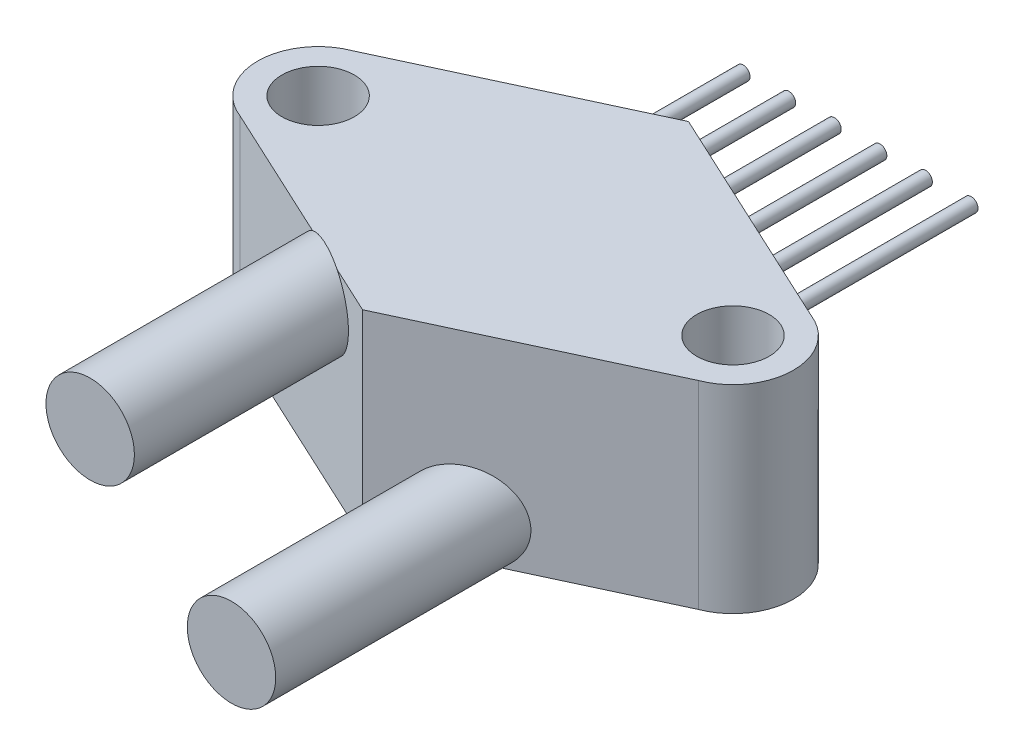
from build123d import *

# Parameters (mm, degrees)
SKETCH1_R                  = 2.0193
EXTRUDE1_DEPTH             = 11.049
SKETCH2_R                  = 2.4638
EXTRUDE2_DEPTH             = 11.176
EXTRUDE2_DIRECTION_2_REACH = 28.017
SKETCH3_R                  = 2.4638
EXTRUDE3_DEPTH             = 11.176
EXTRUDE3_DIRECTION_2_REACH = 28.017
EXTRUDE4_DEPTH             = 11.176
EXTRUDE4_DEPTH_BACK        = 9.3345
SKETCH4_R                  = 0.381


with BuildPart() as part:
    # Sketch1 → Extrude1 (new body)
    with BuildSketch(Plane(origin=(0, 0, 0), x_dir=(1, 0, 0), z_dir=(0, 1, 0))):
        with BuildLine():
            Line((0, -9.0805), (-12.765484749, -3.141043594))
            ThreePointArc((-12.765484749, -3.141043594), (-14.9225, 0), (-12.765484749, 3.141043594))
            Line((-12.765484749, 3.141043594), (0, 9.0805))
            Line((0, 9.0805), (12.765484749, 3.141043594))
            ThreePointArc((12.765484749, 3.141043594), (14.9225, 0), (12.765484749, -3.141043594))
            Line((12.765484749, -3.141043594), (0, -9.0805))
        make_face()
        with Locations(Location((11.557, 0, 0), (0, 0, 270))):
            Circle(SKETCH1_R, mode=Mode.SUBTRACT)
        with Locations(Location((-11.557, 0, 0), (0, 0, 90))):
            Circle(SKETCH1_R, mode=Mode.SUBTRACT)
    extrude(amount=EXTRUDE1_DEPTH)

    # Sketch2 → Extrude2 (add)
    with BuildSketch(Plane.XY.offset(9.144)):
        with Locations(Location((3.937, 2.1082, 0), (0, 0, 238.833843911))):
            Circle(SKETCH2_R)
    extrude(amount=EXTRUDE2_DEPTH)

    # Extrude2 direction 2: up to this face of the body (flat: up to its plane)
    extrude2_direction_2_end = Plane(part.part.faces().sort_by_distance((6.382742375, 5.5245, 6.110771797))[0])
    # Sketch2 → Extrude2 direction 2 (add, up to the picked face)
    with BuildSketch(Plane.XY.offset(9.144), mode=Mode.PRIVATE) as extrude2_direction_2_sk1:
        with Locations(Location((3.937, 2.1082, 0), (0, 0, 238.833843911))):
            Circle(SKETCH2_R)
    extrude2_direction_2_tool1 = split(extrude(extrude2_direction_2_sk1.sketch, amount=-EXTRUDE2_DIRECTION_2_REACH, mode=Mode.PRIVATE), bisect_by=extrude2_direction_2_end, keep=Keep.BOTH, mode=Mode.PRIVATE)
    add(extrude2_direction_2_tool1.solids().sort_by(Axis((3.937, 2.1082, 9.144), (0, 0, -1)))[0])

    # Sketch3 → Extrude3 (add)
    with BuildSketch(Plane.XY.offset(9.144)):
        with Locations(Location((-3.937, 8.9408, 0), (0, 0, 121.166156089))):
            Circle(SKETCH3_R)
    extrude(amount=EXTRUDE3_DEPTH)

    # Extrude3 direction 2: up to this face of the body (flat: up to its plane)
    extrude3_direction_2_end = Plane(part.part.faces().sort_by_distance((-6.382742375, 5.5245, 6.110771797))[0])
    # Sketch3 → Extrude3 direction 2 (add, up to the picked face)
    with BuildSketch(Plane.XY.offset(9.144), mode=Mode.PRIVATE) as extrude3_direction_2_sk1:
        with Locations(Location((-3.937, 8.9408, 0), (0, 0, 121.166156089))):
            Circle(SKETCH3_R)
    extrude3_direction_2_tool1 = split(extrude(extrude3_direction_2_sk1.sketch, amount=-EXTRUDE3_DIRECTION_2_REACH, mode=Mode.PRIVATE), bisect_by=extrude3_direction_2_end, keep=Keep.BOTH, mode=Mode.PRIVATE)
    add(extrude3_direction_2_tool1.solids().sort_by(Axis((-3.937, 8.9408, 9.144), (0, 0, -1)))[0])

    # Sketch4 → Extrude4 (add, two sides: drawn at the far end of the back side and taken through both)
    with BuildSketch(Plane.XY.offset(-9.144).offset(-EXTRUDE4_DEPTH_BACK)):
        with Locations((-1.27, 5.5245)):
            Circle(SKETCH4_R)
        with Locations((-3.81, 5.5245)):
            Circle(SKETCH4_R)
        with Locations((-6.35, 5.5245)):
            Circle(SKETCH4_R)
        with Locations(Location((6.35, 5.5245, 0), (0, 0, 180))):
            Circle(SKETCH4_R)
        with Locations(Location((3.81, 5.5245, 0), (0, 0, 180))):
            Circle(SKETCH4_R)
        with Locations(Location((1.27, 5.5245, 0), (0, 0, 180))):
            Circle(SKETCH4_R)
    extrude(amount=EXTRUDE4_DEPTH + EXTRUDE4_DEPTH_BACK)


solid = part.part
